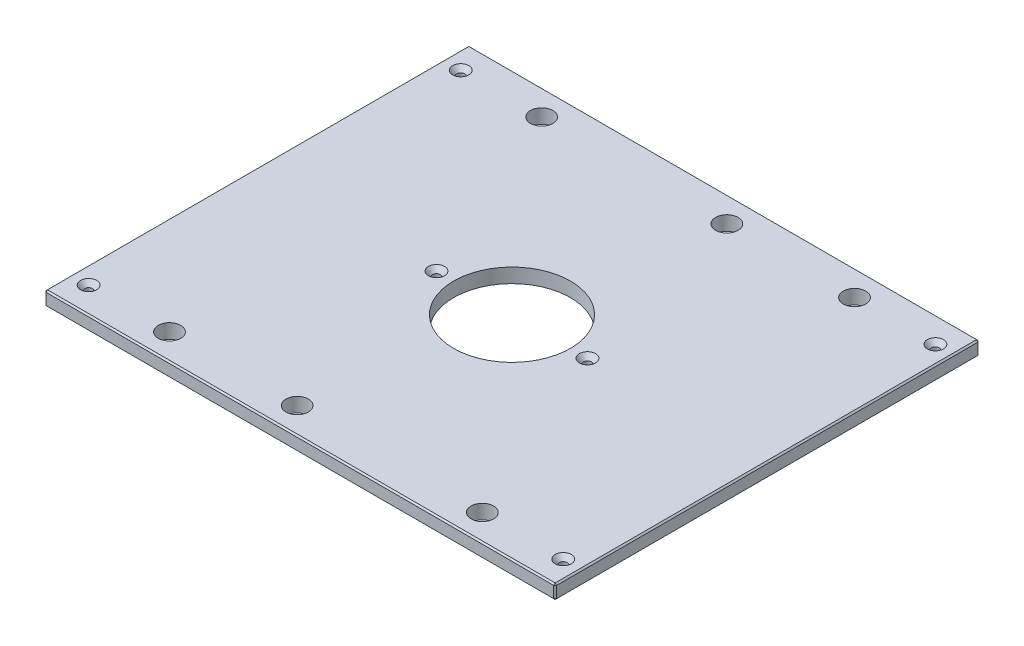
ISO-10303-21;
HEADER;
FILE_DESCRIPTION(('STEP AP214'),'2;1');
FILE_NAME('part.step','',(''),(''),'','','');
FILE_SCHEMA(('AUTOMOTIVE_DESIGN { 1 0 10303 214 1 1 1 1 }'));
ENDSEC;
DATA;
#1=APPLICATION_CONTEXT('core data for automotive mechanical design processes');
#2=APPLICATION_PROTOCOL_DEFINITION('international standard','automotive_design',2000,#1);
#3=PRODUCT_CONTEXT('',#1,'mechanical');
#4=PRODUCT('Part','Part','',(#3));
#5=PRODUCT_RELATED_PRODUCT_CATEGORY('part','',(#4));
#6=PRODUCT_DEFINITION_FORMATION('','',#4);
#7=PRODUCT_DEFINITION_CONTEXT('part definition',#1,'design');
#8=PRODUCT_DEFINITION('design','',#6,#7);
#9=PRODUCT_DEFINITION_SHAPE('','',#8);
#10=(LENGTH_UNIT() NAMED_UNIT(*) SI_UNIT(.MILLI.,.METRE.));
#11=(NAMED_UNIT(*) PLANE_ANGLE_UNIT() SI_UNIT($,.RADIAN.));
#12=(NAMED_UNIT(*) SI_UNIT($,.STERADIAN.) SOLID_ANGLE_UNIT());
#13=UNCERTAINTY_MEASURE_WITH_UNIT(LENGTH_MEASURE(1.E-05),#10,'distance_accuracy_value','');
#14=(GEOMETRIC_REPRESENTATION_CONTEXT(3) GLOBAL_UNCERTAINTY_ASSIGNED_CONTEXT((#13)) GLOBAL_UNIT_ASSIGNED_CONTEXT((#10,
#11,#12)) REPRESENTATION_CONTEXT('',''));
#15=CARTESIAN_POINT('',(0.,0.,0.));
#16=DIRECTION('',(0.,0.,1.));
#17=DIRECTION('',(1.,0.,0.));
#18=AXIS2_PLACEMENT_3D('',#15,#16,#17);
#19=CARTESIAN_POINT('',(-225.425,12.7,-187.325));
#20=DIRECTION('',(1.,0.,0.));
#21=DIRECTION('',(0.,0.,-1.));
#22=AXIS2_PLACEMENT_3D('',#19,#20,#21);
#23=PLANE('',#22);
#24=DIRECTION('',(0.,0.,-1.));
#25=VECTOR('',#24,1.);
#26=CARTESIAN_POINT('',(-225.425,11.4300000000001,-187.325));
#27=LINE('',#26,#25);
#28=CARTESIAN_POINT('',(-225.425,11.4300000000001,186.055));
#29=VERTEX_POINT('',#28);
#30=CARTESIAN_POINT('',(-225.425,11.4300000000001,-186.055));
#31=VERTEX_POINT('',#30);
#32=EDGE_CURVE('E140',#29,#31,#27,.T.);
#33=ORIENTED_EDGE('',*,*,#32,.T.);
#34=DIRECTION('',(0.,-1.,0.));
#35=VECTOR('',#34,1.);
#36=CARTESIAN_POINT('',(-225.425,12.7,-186.055));
#37=LINE('',#36,#35);
#38=CARTESIAN_POINT('',(-225.425,1.26999999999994,-186.055));
#39=VERTEX_POINT('',#38);
#40=EDGE_CURVE('E135',#31,#39,#37,.T.);
#41=ORIENTED_EDGE('',*,*,#40,.T.);
#42=DIRECTION('',(0.,0.,1.));
#43=VECTOR('',#42,1.);
#44=CARTESIAN_POINT('',(-225.425,1.26999999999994,-187.325));
#45=LINE('',#44,#43);
#46=CARTESIAN_POINT('',(-225.425,1.26999999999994,186.055));
#47=VERTEX_POINT('',#46);
#48=EDGE_CURVE('E130',#39,#47,#45,.T.);
#49=ORIENTED_EDGE('',*,*,#48,.T.);
#50=DIRECTION('',(0.,1.,0.));
#51=VECTOR('',#50,1.);
#52=CARTESIAN_POINT('',(-225.425,12.7,186.055));
#53=LINE('',#52,#51);
#54=EDGE_CURVE('E132',#47,#29,#53,.T.);
#55=ORIENTED_EDGE('',*,*,#54,.T.);
#56=EDGE_LOOP('',(#33,#41,#49,#55));
#57=FACE_BOUND('',#56,.T.);
#58=ADVANCED_FACE('F38',(#57),#23,.F.);
#59=CARTESIAN_POINT('',(-225.425,12.7,187.325));
#60=DIRECTION('',(0.,0.,-1.));
#61=DIRECTION('',(-1.,0.,0.));
#62=AXIS2_PLACEMENT_3D('',#59,#60,#61);
#63=PLANE('',#62);
#64=DIRECTION('',(1.,0.,0.));
#65=VECTOR('',#64,1.);
#66=CARTESIAN_POINT('',(-225.425,1.26999999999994,187.325));
#67=LINE('',#66,#65);
#68=CARTESIAN_POINT('',(-224.155,1.26999999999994,187.325));
#69=VERTEX_POINT('',#68);
#70=CARTESIAN_POINT('',(224.155,1.26999999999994,187.325));
#71=VERTEX_POINT('',#70);
#72=EDGE_CURVE('E62',#69,#71,#67,.T.);
#73=ORIENTED_EDGE('',*,*,#72,.T.);
#74=DIRECTION('',(0.,1.,0.));
#75=VECTOR('',#74,1.);
#76=CARTESIAN_POINT('',(224.155,12.7,187.325));
#77=LINE('',#76,#75);
#78=CARTESIAN_POINT('',(224.155,11.4300000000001,187.325));
#79=VERTEX_POINT('',#78);
#80=EDGE_CURVE('E11',#71,#79,#77,.T.);
#81=ORIENTED_EDGE('',*,*,#80,.T.);
#82=DIRECTION('',(-1.,0.,0.));
#83=VECTOR('',#82,1.);
#84=CARTESIAN_POINT('',(-225.425,11.4300000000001,187.325));
#85=LINE('',#84,#83);
#86=CARTESIAN_POINT('',(-224.155,11.4300000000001,187.325));
#87=VERTEX_POINT('',#86);
#88=EDGE_CURVE('E48',#79,#87,#85,.T.);
#89=ORIENTED_EDGE('',*,*,#88,.T.);
#90=DIRECTION('',(0.,-1.,0.));
#91=VECTOR('',#90,1.);
#92=CARTESIAN_POINT('',(-224.155,12.7,187.325));
#93=LINE('',#92,#91);
#94=EDGE_CURVE('E349',#87,#69,#93,.T.);
#95=ORIENTED_EDGE('',*,*,#94,.T.);
#96=EDGE_LOOP('',(#73,#81,#89,#95));
#97=FACE_BOUND('',#96,.T.);
#98=ADVANCED_FACE('F427',(#97),#63,.F.);
#99=CARTESIAN_POINT('',(225.425,12.7,-187.325));
#100=DIRECTION('',(-1.,0.,0.));
#101=DIRECTION('',(0.,0.,1.));
#102=AXIS2_PLACEMENT_3D('',#99,#100,#101);
#103=PLANE('',#102);
#104=DIRECTION('',(0.,0.,-1.));
#105=VECTOR('',#104,1.);
#106=CARTESIAN_POINT('',(225.425,1.26999999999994,-187.325));
#107=LINE('',#106,#105);
#108=CARTESIAN_POINT('',(225.425,1.26999999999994,186.055));
#109=VERTEX_POINT('',#108);
#110=CARTESIAN_POINT('',(225.425,1.26999999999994,-186.055));
#111=VERTEX_POINT('',#110);
#112=EDGE_CURVE('E342',#109,#111,#107,.T.);
#113=ORIENTED_EDGE('',*,*,#112,.T.);
#114=DIRECTION('',(0.,1.,0.));
#115=VECTOR('',#114,1.);
#116=CARTESIAN_POINT('',(225.425,12.7,-186.055));
#117=LINE('',#116,#115);
#118=CARTESIAN_POINT('',(225.425,11.4300000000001,-186.055));
#119=VERTEX_POINT('',#118);
#120=EDGE_CURVE('E345',#111,#119,#117,.T.);
#121=ORIENTED_EDGE('',*,*,#120,.T.);
#122=DIRECTION('',(0.,0.,1.));
#123=VECTOR('',#122,1.);
#124=CARTESIAN_POINT('',(225.425,11.4300000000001,187.325));
#125=LINE('',#124,#123);
#126=CARTESIAN_POINT('',(225.425,11.4300000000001,186.055));
#127=VERTEX_POINT('',#126);
#128=EDGE_CURVE('E339',#119,#127,#125,.T.);
#129=ORIENTED_EDGE('',*,*,#128,.T.);
#130=DIRECTION('',(0.,-1.,0.));
#131=VECTOR('',#130,1.);
#132=CARTESIAN_POINT('',(225.425,12.7,186.055));
#133=LINE('',#132,#131);
#134=EDGE_CURVE('E336',#127,#109,#133,.T.);
#135=ORIENTED_EDGE('',*,*,#134,.T.);
#136=EDGE_LOOP('',(#113,#121,#129,#135));
#137=FACE_BOUND('',#136,.T.);
#138=ADVANCED_FACE('F414',(#137),#103,.F.);
#139=CARTESIAN_POINT('',(-225.425,12.7,-187.325));
#140=DIRECTION('',(0.,0.,1.));
#141=DIRECTION('',(1.,0.,0.));
#142=AXIS2_PLACEMENT_3D('',#139,#140,#141);
#143=PLANE('',#142);
#144=DIRECTION('',(-1.,0.,0.));
#145=VECTOR('',#144,1.);
#146=CARTESIAN_POINT('',(-225.425,1.26999999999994,-187.325));
#147=LINE('',#146,#145);
#148=CARTESIAN_POINT('',(224.155,1.26999999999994,-187.325));
#149=VERTEX_POINT('',#148);
#150=CARTESIAN_POINT('',(-224.155,1.26999999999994,-187.325));
#151=VERTEX_POINT('',#150);
#152=EDGE_CURVE('E301',#149,#151,#147,.T.);
#153=ORIENTED_EDGE('',*,*,#152,.T.);
#154=DIRECTION('',(0.,1.,0.));
#155=VECTOR('',#154,1.);
#156=CARTESIAN_POINT('',(-224.155,12.7,-187.325));
#157=LINE('',#156,#155);
#158=CARTESIAN_POINT('',(-224.155,11.4300000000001,-187.325));
#159=VERTEX_POINT('',#158);
#160=EDGE_CURVE('E307',#151,#159,#157,.T.);
#161=ORIENTED_EDGE('',*,*,#160,.T.);
#162=DIRECTION('',(1.,0.,0.));
#163=VECTOR('',#162,1.);
#164=CARTESIAN_POINT('',(225.425,11.4300000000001,-187.325));
#165=LINE('',#164,#163);
#166=CARTESIAN_POINT('',(224.155,11.4300000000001,-187.325));
#167=VERTEX_POINT('',#166);
#168=EDGE_CURVE('E304',#159,#167,#165,.T.);
#169=ORIENTED_EDGE('',*,*,#168,.T.);
#170=DIRECTION('',(0.,-1.,0.));
#171=VECTOR('',#170,1.);
#172=CARTESIAN_POINT('',(224.155,12.7,-187.325));
#173=LINE('',#172,#171);
#174=EDGE_CURVE('E299',#167,#149,#173,.T.);
#175=ORIENTED_EDGE('',*,*,#174,.T.);
#176=EDGE_LOOP('',(#153,#161,#169,#175));
#177=FACE_BOUND('',#176,.T.);
#178=ADVANCED_FACE('F388',(#177),#143,.F.);
#179=CARTESIAN_POINT('',(0.,12.7,0.));
#180=DIRECTION('',(0.,1.,0.));
#181=DIRECTION('',(0.,0.,1.));
#182=AXIS2_PLACEMENT_3D('',#179,#180,#181);
#183=PLANE('',#182);
#184=CARTESIAN_POINT('',(209.55,12.7,-164.30498));
#185=DIRECTION('',(0.,1.,0.));
#186=DIRECTION('',(0.,0.,1.));
#187=AXIS2_PLACEMENT_3D('',#184,#185,#186);
#188=CIRCLE('',#187,7.13739999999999);
#189=CARTESIAN_POINT('',(209.55,12.7,-157.16758));
#190=VERTEX_POINT('',#189);
#191=EDGE_CURVE('E927',#190,#190,#188,.T.);
#192=ORIENTED_EDGE('',*,*,#191,.F.);
#193=EDGE_LOOP('',(#192));
#194=FACE_BOUND('',#193,.T.);
#195=CARTESIAN_POINT('',(209.55,12.7,164.30498));
#196=DIRECTION('',(0.,1.,0.));
#197=DIRECTION('',(0.,0.,1.));
#198=AXIS2_PLACEMENT_3D('',#195,#196,#197);
#199=CIRCLE('',#198,7.13739999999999);
#200=CARTESIAN_POINT('',(209.55,12.7,171.44238));
#201=VERTEX_POINT('',#200);
#202=EDGE_CURVE('E931',#201,#201,#199,.T.);
#203=ORIENTED_EDGE('',*,*,#202,.F.);
#204=EDGE_LOOP('',(#203));
#205=FACE_BOUND('',#204,.T.);
#206=CARTESIAN_POINT('',(-209.55,12.7,164.30498));
#207=DIRECTION('',(0.,1.,0.));
#208=DIRECTION('',(0.,0.,1.));
#209=AXIS2_PLACEMENT_3D('',#206,#207,#208);
#210=CIRCLE('',#209,7.13739999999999);
#211=CARTESIAN_POINT('',(-209.55,12.7,171.44238));
#212=VERTEX_POINT('',#211);
#213=EDGE_CURVE('E935',#212,#212,#210,.T.);
#214=ORIENTED_EDGE('',*,*,#213,.F.);
#215=EDGE_LOOP('',(#214));
#216=FACE_BOUND('',#215,.T.);
#217=CARTESIAN_POINT('',(-66.675,12.7,0.));
#218=DIRECTION('',(0.,1.,0.));
#219=DIRECTION('',(0.,0.,1.));
#220=AXIS2_PLACEMENT_3D('',#217,#218,#219);
#221=CIRCLE('',#220,7.1374);
#222=CARTESIAN_POINT('',(-66.675,12.7,7.1374));
#223=VERTEX_POINT('',#222);
#224=EDGE_CURVE('E939',#223,#223,#221,.T.);
#225=ORIENTED_EDGE('',*,*,#224,.F.);
#226=EDGE_LOOP('',(#225));
#227=FACE_BOUND('',#226,.T.);
#228=CARTESIAN_POINT('',(66.675,12.7,0.));
#229=DIRECTION('',(0.,1.,0.));
#230=DIRECTION('',(0.,0.,1.));
#231=AXIS2_PLACEMENT_3D('',#228,#229,#230);
#232=CIRCLE('',#231,7.1374);
#233=CARTESIAN_POINT('',(66.675,12.7,7.1374));
#234=VERTEX_POINT('',#233);
#235=EDGE_CURVE('E943',#234,#234,#232,.T.);
#236=ORIENTED_EDGE('',*,*,#235,.F.);
#237=EDGE_LOOP('',(#236));
#238=FACE_BOUND('',#237,.T.);
#239=CARTESIAN_POINT('',(-209.55,12.7,-164.30498));
#240=DIRECTION('',(0.,1.,0.));
#241=DIRECTION('',(0.,0.,1.));
#242=AXIS2_PLACEMENT_3D('',#239,#240,#241);
#243=CIRCLE('',#242,7.13739999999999);
#244=CARTESIAN_POINT('',(-209.55,12.7,-157.16758));
#245=VERTEX_POINT('',#244);
#246=EDGE_CURVE('E946',#245,#245,#243,.T.);
#247=ORIENTED_EDGE('',*,*,#246,.F.);
#248=EDGE_LOOP('',(#247));
#249=FACE_BOUND('',#248,.T.);
#250=DIRECTION('',(0.,0.,-1.));
#251=VECTOR('',#250,1.);
#252=CARTESIAN_POINT('',(224.155,12.7,-187.325));
#253=LINE('',#252,#251);
#254=CARTESIAN_POINT('',(224.155,12.7,186.055));
#255=VERTEX_POINT('',#254);
#256=CARTESIAN_POINT('',(224.155,12.7,-186.055));
#257=VERTEX_POINT('',#256);
#258=EDGE_CURVE('E317',#255,#257,#253,.T.);
#259=ORIENTED_EDGE('',*,*,#258,.T.);
#260=DIRECTION('',(-1.,0.,0.));
#261=VECTOR('',#260,1.);
#262=CARTESIAN_POINT('',(-225.425,12.7,-186.055));
#263=LINE('',#262,#261);
#264=CARTESIAN_POINT('',(-224.155,12.7,-186.055));
#265=VERTEX_POINT('',#264);
#266=EDGE_CURVE('E320',#257,#265,#263,.T.);
#267=ORIENTED_EDGE('',*,*,#266,.T.);
#268=DIRECTION('',(0.,0.,1.));
#269=VECTOR('',#268,1.);
#270=CARTESIAN_POINT('',(-224.155,12.7,187.325));
#271=LINE('',#270,#269);
#272=CARTESIAN_POINT('',(-224.155,12.7,186.055));
#273=VERTEX_POINT('',#272);
#274=EDGE_CURVE('E314',#265,#273,#271,.T.);
#275=ORIENTED_EDGE('',*,*,#274,.T.);
#276=DIRECTION('',(1.,0.,0.));
#277=VECTOR('',#276,1.);
#278=CARTESIAN_POINT('',(225.425,12.7,186.055));
#279=LINE('',#278,#277);
#280=EDGE_CURVE('E311',#273,#255,#279,.T.);
#281=ORIENTED_EDGE('',*,*,#280,.T.);
#282=EDGE_LOOP('',(#259,#267,#275,#281));
#283=FACE_BOUND('',#282,.T.);
#284=CARTESIAN_POINT('',(138.1125,12.7,-164.30498));
#285=DIRECTION('',(0.,1.,0.));
#286=DIRECTION('',(0.,0.,1.));
#287=AXIS2_PLACEMENT_3D('',#284,#285,#286);
#288=CIRCLE('',#287,9.921875);
#289=CARTESIAN_POINT('',(138.1125,12.7,-154.383105));
#290=VERTEX_POINT('',#289);
#291=EDGE_CURVE('E230',#290,#290,#288,.T.);
#292=ORIENTED_EDGE('',*,*,#291,.F.);
#293=EDGE_LOOP('',(#292));
#294=FACE_BOUND('',#293,.T.);
#295=CARTESIAN_POINT('',(-138.1125,12.7,-164.30498));
#296=DIRECTION('',(0.,1.,0.));
#297=DIRECTION('',(0.,0.,1.));
#298=AXIS2_PLACEMENT_3D('',#295,#296,#297);
#299=CIRCLE('',#298,9.921875);
#300=CARTESIAN_POINT('',(-138.1125,12.7,-154.383105));
#301=VERTEX_POINT('',#300);
#302=EDGE_CURVE('E244',#301,#301,#299,.T.);
#303=ORIENTED_EDGE('',*,*,#302,.F.);
#304=EDGE_LOOP('',(#303));
#305=FACE_BOUND('',#304,.T.);
#306=CARTESIAN_POINT('',(138.1125,12.7,164.30498));
#307=DIRECTION('',(0.,1.,0.));
#308=DIRECTION('',(0.,0.,1.));
#309=AXIS2_PLACEMENT_3D('',#306,#307,#308);
#310=CIRCLE('',#309,9.921875);
#311=CARTESIAN_POINT('',(138.1125,12.7,174.226855));
#312=VERTEX_POINT('',#311);
#313=EDGE_CURVE('E257',#312,#312,#310,.T.);
#314=ORIENTED_EDGE('',*,*,#313,.F.);
#315=EDGE_LOOP('',(#314));
#316=FACE_BOUND('',#315,.T.);
#317=CARTESIAN_POINT('',(-138.1125,12.7,164.30498));
#318=DIRECTION('',(0.,1.,0.));
#319=DIRECTION('',(0.,0.,1.));
#320=AXIS2_PLACEMENT_3D('',#317,#318,#319);
#321=CIRCLE('',#320,9.921875);
#322=CARTESIAN_POINT('',(-138.1125,12.7,174.226855));
#323=VERTEX_POINT('',#322);
#324=EDGE_CURVE('E265',#323,#323,#321,.T.);
#325=ORIENTED_EDGE('',*,*,#324,.F.);
#326=EDGE_LOOP('',(#325));
#327=FACE_BOUND('',#326,.T.);
#328=CARTESIAN_POINT('',(25.4,12.7,-164.30498));
#329=DIRECTION('',(0.,1.,0.));
#330=DIRECTION('',(0.,0.,1.));
#331=AXIS2_PLACEMENT_3D('',#328,#329,#330);
#332=CIRCLE('',#331,9.921875);
#333=CARTESIAN_POINT('',(25.4,12.7,-154.383105));
#334=VERTEX_POINT('',#333);
#335=EDGE_CURVE('E273',#334,#334,#332,.T.);
#336=ORIENTED_EDGE('',*,*,#335,.F.);
#337=EDGE_LOOP('',(#336));
#338=FACE_BOUND('',#337,.T.);
#339=CARTESIAN_POINT('',(-25.4,12.7,164.30498));
#340=DIRECTION('',(0.,1.,0.));
#341=DIRECTION('',(0.,0.,1.));
#342=AXIS2_PLACEMENT_3D('',#339,#340,#341);
#343=CIRCLE('',#342,9.921875);
#344=CARTESIAN_POINT('',(-25.4,12.7,174.226855));
#345=VERTEX_POINT('',#344);
#346=EDGE_CURVE('E281',#345,#345,#343,.T.);
#347=ORIENTED_EDGE('',*,*,#346,.F.);
#348=EDGE_LOOP('',(#347));
#349=FACE_BOUND('',#348,.T.);
#350=CARTESIAN_POINT('',(0.,12.7,0.));
#351=DIRECTION('',(0.,1.,0.));
#352=DIRECTION('',(0.,0.,1.));
#353=AXIS2_PLACEMENT_3D('',#350,#351,#352);
#354=CIRCLE('',#353,51.562);
#355=CARTESIAN_POINT('',(0.,12.7,51.562));
#356=VERTEX_POINT('',#355);
#357=EDGE_CURVE('E288',#356,#356,#354,.T.);
#358=ORIENTED_EDGE('',*,*,#357,.F.);
#359=EDGE_LOOP('',(#358));
#360=FACE_BOUND('',#359,.T.);
#361=ADVANCED_FACE('F436',(#194,#205,#216,#227,#238,#249,#283,#294,#305,#316,#327,#338,#349,
#360),#183,.T.);
#362=CARTESIAN_POINT('',(0.,0.,0.));
#363=DIRECTION('',(0.,1.,0.));
#364=DIRECTION('',(0.,0.,1.));
#365=AXIS2_PLACEMENT_3D('',#362,#363,#364);
#366=PLANE('',#365);
#367=CARTESIAN_POINT('',(209.55,0.,-164.30498));
#368=DIRECTION('',(0.,1.,0.));
#369=DIRECTION('',(0.,0.,1.));
#370=AXIS2_PLACEMENT_3D('',#367,#368,#369);
#371=CIRCLE('',#370,3.3782);
#372=CARTESIAN_POINT('',(209.55,0.,-160.92678));
#373=VERTEX_POINT('',#372);
#374=EDGE_CURVE('E993',#373,#373,#371,.T.);
#375=ORIENTED_EDGE('',*,*,#374,.T.);
#376=EDGE_LOOP('',(#375));
#377=FACE_BOUND('',#376,.T.);
#378=CARTESIAN_POINT('',(209.55,0.,164.30498));
#379=DIRECTION('',(0.,1.,0.));
#380=DIRECTION('',(0.,0.,1.));
#381=AXIS2_PLACEMENT_3D('',#378,#379,#380);
#382=CIRCLE('',#381,3.3782);
#383=CARTESIAN_POINT('',(209.55,0.,167.68318));
#384=VERTEX_POINT('',#383);
#385=EDGE_CURVE('E984',#384,#384,#382,.T.);
#386=ORIENTED_EDGE('',*,*,#385,.T.);
#387=EDGE_LOOP('',(#386));
#388=FACE_BOUND('',#387,.T.);
#389=CARTESIAN_POINT('',(-209.55,0.,164.30498));
#390=DIRECTION('',(0.,1.,0.));
#391=DIRECTION('',(0.,0.,1.));
#392=AXIS2_PLACEMENT_3D('',#389,#390,#391);
#393=CIRCLE('',#392,3.3782);
#394=CARTESIAN_POINT('',(-209.55,0.,167.68318));
#395=VERTEX_POINT('',#394);
#396=EDGE_CURVE('E974',#395,#395,#393,.T.);
#397=ORIENTED_EDGE('',*,*,#396,.T.);
#398=EDGE_LOOP('',(#397));
#399=FACE_BOUND('',#398,.T.);
#400=CARTESIAN_POINT('',(-66.675,0.,0.));
#401=DIRECTION('',(0.,1.,0.));
#402=DIRECTION('',(0.,0.,1.));
#403=AXIS2_PLACEMENT_3D('',#400,#401,#402);
#404=CIRCLE('',#403,3.3782);
#405=CARTESIAN_POINT('',(-66.675,0.,3.3782));
#406=VERTEX_POINT('',#405);
#407=EDGE_CURVE('E964',#406,#406,#404,.T.);
#408=ORIENTED_EDGE('',*,*,#407,.T.);
#409=EDGE_LOOP('',(#408));
#410=FACE_BOUND('',#409,.T.);
#411=CARTESIAN_POINT('',(66.675,0.,0.));
#412=DIRECTION('',(0.,1.,0.));
#413=DIRECTION('',(0.,0.,1.));
#414=AXIS2_PLACEMENT_3D('',#411,#412,#413);
#415=CIRCLE('',#414,3.3782);
#416=CARTESIAN_POINT('',(66.675,0.,3.3782));
#417=VERTEX_POINT('',#416);
#418=EDGE_CURVE('E950',#417,#417,#415,.T.);
#419=ORIENTED_EDGE('',*,*,#418,.T.);
#420=EDGE_LOOP('',(#419));
#421=FACE_BOUND('',#420,.T.);
#422=CARTESIAN_POINT('',(-209.55,0.,-164.30498));
#423=DIRECTION('',(0.,1.,0.));
#424=DIRECTION('',(0.,0.,1.));
#425=AXIS2_PLACEMENT_3D('',#422,#423,#424);
#426=CIRCLE('',#425,3.3782);
#427=CARTESIAN_POINT('',(-209.55,0.,-160.92678));
#428=VERTEX_POINT('',#427);
#429=EDGE_CURVE('E247',#428,#428,#426,.T.);
#430=ORIENTED_EDGE('',*,*,#429,.T.);
#431=EDGE_LOOP('',(#430));
#432=FACE_BOUND('',#431,.T.);
#433=DIRECTION('',(0.,0.,-1.));
#434=VECTOR('',#433,1.);
#435=CARTESIAN_POINT('',(-224.155,0.,0.));
#436=LINE('',#435,#434);
#437=CARTESIAN_POINT('',(-224.155,0.,186.055));
#438=VERTEX_POINT('',#437);
#439=CARTESIAN_POINT('',(-224.155,0.,-186.055));
#440=VERTEX_POINT('',#439);
#441=EDGE_CURVE('E165',#438,#440,#436,.T.);
#442=ORIENTED_EDGE('',*,*,#441,.T.);
#443=DIRECTION('',(1.,0.,0.));
#444=VECTOR('',#443,1.);
#445=CARTESIAN_POINT('',(0.,0.,-186.055));
#446=LINE('',#445,#444);
#447=CARTESIAN_POINT('',(224.155,0.,-186.055));
#448=VERTEX_POINT('',#447);
#449=EDGE_CURVE('E332',#440,#448,#446,.T.);
#450=ORIENTED_EDGE('',*,*,#449,.T.);
#451=DIRECTION('',(0.,0.,1.));
#452=VECTOR('',#451,1.);
#453=CARTESIAN_POINT('',(224.155,0.,0.));
#454=LINE('',#453,#452);
#455=CARTESIAN_POINT('',(224.155,0.,186.055));
#456=VERTEX_POINT('',#455);
#457=EDGE_CURVE('E329',#448,#456,#454,.T.);
#458=ORIENTED_EDGE('',*,*,#457,.T.);
#459=DIRECTION('',(-1.,0.,0.));
#460=VECTOR('',#459,1.);
#461=CARTESIAN_POINT('',(0.,0.,186.055));
#462=LINE('',#461,#460);
#463=EDGE_CURVE('E324',#456,#438,#462,.T.);
#464=ORIENTED_EDGE('',*,*,#463,.T.);
#465=EDGE_LOOP('',(#442,#450,#458,#464));
#466=FACE_BOUND('',#465,.T.);
#467=CARTESIAN_POINT('',(138.1125,0.,-164.30498));
#468=DIRECTION('',(0.,1.,0.));
#469=DIRECTION('',(0.,0.,1.));
#470=AXIS2_PLACEMENT_3D('',#467,#468,#469);
#471=CIRCLE('',#470,9.921875);
#472=CARTESIAN_POINT('',(138.1125,0.,-154.383105));
#473=VERTEX_POINT('',#472);
#474=EDGE_CURVE('E237',#473,#473,#471,.T.);
#475=ORIENTED_EDGE('',*,*,#474,.T.);
#476=EDGE_LOOP('',(#475));
#477=FACE_BOUND('',#476,.T.);
#478=CARTESIAN_POINT('',(-138.1125,0.,-164.30498));
#479=DIRECTION('',(0.,1.,0.));
#480=DIRECTION('',(0.,0.,1.));
#481=AXIS2_PLACEMENT_3D('',#478,#479,#480);
#482=CIRCLE('',#481,9.921875);
#483=CARTESIAN_POINT('',(-138.1125,0.,-154.383105));
#484=VERTEX_POINT('',#483);
#485=EDGE_CURVE('E253',#484,#484,#482,.T.);
#486=ORIENTED_EDGE('',*,*,#485,.T.);
#487=EDGE_LOOP('',(#486));
#488=FACE_BOUND('',#487,.T.);
#489=CARTESIAN_POINT('',(138.1125,0.,164.30498));
#490=DIRECTION('',(0.,1.,0.));
#491=DIRECTION('',(0.,0.,1.));
#492=AXIS2_PLACEMENT_3D('',#489,#490,#491);
#493=CIRCLE('',#492,9.921875);
#494=CARTESIAN_POINT('',(138.1125,0.,174.226855));
#495=VERTEX_POINT('',#494);
#496=EDGE_CURVE('E261',#495,#495,#493,.T.);
#497=ORIENTED_EDGE('',*,*,#496,.T.);
#498=EDGE_LOOP('',(#497));
#499=FACE_BOUND('',#498,.T.);
#500=CARTESIAN_POINT('',(-138.1125,0.,164.30498));
#501=DIRECTION('',(0.,1.,0.));
#502=DIRECTION('',(0.,0.,1.));
#503=AXIS2_PLACEMENT_3D('',#500,#501,#502);
#504=CIRCLE('',#503,9.921875);
#505=CARTESIAN_POINT('',(-138.1125,0.,174.226855));
#506=VERTEX_POINT('',#505);
#507=EDGE_CURVE('E269',#506,#506,#504,.T.);
#508=ORIENTED_EDGE('',*,*,#507,.T.);
#509=EDGE_LOOP('',(#508));
#510=FACE_BOUND('',#509,.T.);
#511=CARTESIAN_POINT('',(25.4,0.,-164.30498));
#512=DIRECTION('',(0.,1.,0.));
#513=DIRECTION('',(0.,0.,1.));
#514=AXIS2_PLACEMENT_3D('',#511,#512,#513);
#515=CIRCLE('',#514,9.921875);
#516=CARTESIAN_POINT('',(25.4,0.,-154.383105));
#517=VERTEX_POINT('',#516);
#518=EDGE_CURVE('E277',#517,#517,#515,.T.);
#519=ORIENTED_EDGE('',*,*,#518,.T.);
#520=EDGE_LOOP('',(#519));
#521=FACE_BOUND('',#520,.T.);
#522=CARTESIAN_POINT('',(-25.4,0.,164.30498));
#523=DIRECTION('',(0.,1.,0.));
#524=DIRECTION('',(0.,0.,1.));
#525=AXIS2_PLACEMENT_3D('',#522,#523,#524);
#526=CIRCLE('',#525,9.921875);
#527=CARTESIAN_POINT('',(-25.4,0.,174.226855));
#528=VERTEX_POINT('',#527);
#529=EDGE_CURVE('E284',#528,#528,#526,.T.);
#530=ORIENTED_EDGE('',*,*,#529,.T.);
#531=EDGE_LOOP('',(#530));
#532=FACE_BOUND('',#531,.T.);
#533=CARTESIAN_POINT('',(0.,0.,0.));
#534=DIRECTION('',(0.,1.,0.));
#535=DIRECTION('',(0.,0.,1.));
#536=AXIS2_PLACEMENT_3D('',#533,#534,#535);
#537=CIRCLE('',#536,51.562);
#538=CARTESIAN_POINT('',(0.,0.,51.562));
#539=VERTEX_POINT('',#538);
#540=EDGE_CURVE('E153',#539,#539,#537,.T.);
#541=ORIENTED_EDGE('',*,*,#540,.T.);
#542=EDGE_LOOP('',(#541));
#543=FACE_BOUND('',#542,.T.);
#544=ADVANCED_FACE('F401',(#377,#388,#399,#410,#421,#432,#466,#477,#488,#499,#510,#521,#532,
#543),#366,.F.);
#545=CARTESIAN_POINT('',(0.,0.,0.));
#546=DIRECTION('',(0.,1.,0.));
#547=DIRECTION('',(0.,0.,1.));
#548=AXIS2_PLACEMENT_3D('',#545,#546,#547);
#549=CYLINDRICAL_SURFACE('',#548,51.562);
#550=ORIENTED_EDGE('',*,*,#540,.F.);
#551=EDGE_LOOP('',(#550));
#552=FACE_BOUND('',#551,.T.);
#553=ORIENTED_EDGE('',*,*,#357,.T.);
#554=EDGE_LOOP('',(#553));
#555=FACE_BOUND('',#554,.T.);
#556=ADVANCED_FACE('F682',(#552,#555),#549,.F.);
#557=CARTESIAN_POINT('',(-25.4,12.7,164.30498));
#558=DIRECTION('',(0.,1.,0.));
#559=DIRECTION('',(0.,0.,1.));
#560=AXIS2_PLACEMENT_3D('',#557,#558,#559);
#561=CYLINDRICAL_SURFACE('',#560,9.921875);
#562=ORIENTED_EDGE('',*,*,#529,.F.);
#563=EDGE_LOOP('',(#562));
#564=FACE_BOUND('',#563,.T.);
#565=ORIENTED_EDGE('',*,*,#346,.T.);
#566=EDGE_LOOP('',(#565));
#567=FACE_BOUND('',#566,.T.);
#568=ADVANCED_FACE('F856',(#564,#567),#561,.F.);
#569=CARTESIAN_POINT('',(25.4,12.7,-164.30498));
#570=DIRECTION('',(0.,1.,0.));
#571=DIRECTION('',(0.,0.,1.));
#572=AXIS2_PLACEMENT_3D('',#569,#570,#571);
#573=CYLINDRICAL_SURFACE('',#572,9.921875);
#574=ORIENTED_EDGE('',*,*,#518,.F.);
#575=EDGE_LOOP('',(#574));
#576=FACE_BOUND('',#575,.T.);
#577=ORIENTED_EDGE('',*,*,#335,.T.);
#578=EDGE_LOOP('',(#577));
#579=FACE_BOUND('',#578,.T.);
#580=ADVANCED_FACE('F846',(#576,#579),#573,.F.);
#581=CARTESIAN_POINT('',(-138.1125,12.7,164.30498));
#582=DIRECTION('',(0.,1.,0.));
#583=DIRECTION('',(0.,0.,1.));
#584=AXIS2_PLACEMENT_3D('',#581,#582,#583);
#585=CYLINDRICAL_SURFACE('',#584,9.921875);
#586=ORIENTED_EDGE('',*,*,#507,.F.);
#587=EDGE_LOOP('',(#586));
#588=FACE_BOUND('',#587,.T.);
#589=ORIENTED_EDGE('',*,*,#324,.T.);
#590=EDGE_LOOP('',(#589));
#591=FACE_BOUND('',#590,.T.);
#592=ADVANCED_FACE('F836',(#588,#591),#585,.F.);
#593=CARTESIAN_POINT('',(138.1125,12.7,164.30498));
#594=DIRECTION('',(0.,1.,0.));
#595=DIRECTION('',(0.,0.,1.));
#596=AXIS2_PLACEMENT_3D('',#593,#594,#595);
#597=CYLINDRICAL_SURFACE('',#596,9.921875);
#598=ORIENTED_EDGE('',*,*,#496,.F.);
#599=EDGE_LOOP('',(#598));
#600=FACE_BOUND('',#599,.T.);
#601=ORIENTED_EDGE('',*,*,#313,.T.);
#602=EDGE_LOOP('',(#601));
#603=FACE_BOUND('',#602,.T.);
#604=ADVANCED_FACE('F826',(#600,#603),#597,.F.);
#605=CARTESIAN_POINT('',(-138.1125,12.7,-164.30498));
#606=DIRECTION('',(0.,1.,0.));
#607=DIRECTION('',(0.,0.,1.));
#608=AXIS2_PLACEMENT_3D('',#605,#606,#607);
#609=CYLINDRICAL_SURFACE('',#608,9.921875);
#610=ORIENTED_EDGE('',*,*,#485,.F.);
#611=EDGE_LOOP('',(#610));
#612=FACE_BOUND('',#611,.T.);
#613=ORIENTED_EDGE('',*,*,#302,.T.);
#614=EDGE_LOOP('',(#613));
#615=FACE_BOUND('',#614,.T.);
#616=ADVANCED_FACE('F816',(#612,#615),#609,.F.);
#617=CARTESIAN_POINT('',(138.1125,12.7,-164.30498));
#618=DIRECTION('',(0.,1.,0.));
#619=DIRECTION('',(0.,0.,1.));
#620=AXIS2_PLACEMENT_3D('',#617,#618,#619);
#621=CYLINDRICAL_SURFACE('',#620,9.921875);
#622=ORIENTED_EDGE('',*,*,#474,.F.);
#623=EDGE_LOOP('',(#622));
#624=FACE_BOUND('',#623,.T.);
#625=ORIENTED_EDGE('',*,*,#291,.T.);
#626=EDGE_LOOP('',(#625));
#627=FACE_BOUND('',#626,.T.);
#628=ADVANCED_FACE('F445',(#624,#627),#621,.F.);
#629=CARTESIAN_POINT('',(225.425,12.7,186.055));
#630=DIRECTION('',(-0.707106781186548,0.,-0.707106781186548));
#631=DIRECTION('',(0.,-1.,0.));
#632=AXIS2_PLACEMENT_3D('',#629,#630,#631);
#633=PLANE('',#632);
#634=DIRECTION('',(-0.707106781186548,0.,0.707106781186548));
#635=VECTOR('',#634,1.);
#636=CARTESIAN_POINT('',(225.425,11.4300000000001,186.055));
#637=LINE('',#636,#635);
#638=EDGE_CURVE('E42',#79,#127,#637,.F.);
#639=ORIENTED_EDGE('',*,*,#638,.F.);
#640=ORIENTED_EDGE('',*,*,#80,.F.);
#641=DIRECTION('',(0.707106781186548,0.,-0.707106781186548));
#642=VECTOR('',#641,1.);
#643=CARTESIAN_POINT('',(224.79,1.26999999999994,186.69));
#644=LINE('',#643,#642);
#645=EDGE_CURVE('E220',#109,#71,#644,.F.);
#646=ORIENTED_EDGE('',*,*,#645,.F.);
#647=ORIENTED_EDGE('',*,*,#134,.F.);
#648=EDGE_LOOP('',(#639,#640,#646,#647));
#649=FACE_BOUND('',#648,.T.);
#650=ADVANCED_FACE('F40',(#649),#633,.F.);
#651=CARTESIAN_POINT('',(225.425,11.4300000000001,186.055));
#652=DIRECTION('',(0.577350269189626,0.577350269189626,0.577350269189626));
#653=DIRECTION('',(0.707106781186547,0.,-0.707106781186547));
#654=AXIS2_PLACEMENT_3D('',#651,#652,#653);
#655=PLANE('',#654);
#656=DIRECTION('',(0.,-0.707106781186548,0.707106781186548));
#657=VECTOR('',#656,1.);
#658=CARTESIAN_POINT('',(224.155,12.065,186.69));
#659=LINE('',#658,#657);
#660=EDGE_CURVE('E214',#79,#255,#659,.F.);
#661=ORIENTED_EDGE('',*,*,#660,.F.);
#662=ORIENTED_EDGE('',*,*,#638,.T.);
#663=DIRECTION('',(-0.707106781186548,0.707106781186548,0.));
#664=VECTOR('',#663,1.);
#665=CARTESIAN_POINT('',(225.425,11.4300000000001,186.055));
#666=LINE('',#665,#664);
#667=EDGE_CURVE('E217',#255,#127,#666,.F.);
#668=ORIENTED_EDGE('',*,*,#667,.F.);
#669=EDGE_LOOP('',(#661,#662,#668));
#670=FACE_BOUND('',#669,.T.);
#671=ADVANCED_FACE('F438',(#670),#655,.T.);
#672=CARTESIAN_POINT('',(224.155,0.,186.055));
#673=DIRECTION('',(0.577350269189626,-0.577350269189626,0.577350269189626));
#674=DIRECTION('',(0.707106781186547,0.,-0.707106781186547));
#675=AXIS2_PLACEMENT_3D('',#672,#673,#674);
#676=PLANE('',#675);
#677=DIRECTION('',(-0.707106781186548,-0.707106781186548,0.));
#678=VECTOR('',#677,1.);
#679=CARTESIAN_POINT('',(224.155,0.,186.055));
#680=LINE('',#679,#678);
#681=EDGE_CURVE('E206',#109,#456,#680,.T.);
#682=ORIENTED_EDGE('',*,*,#681,.F.);
#683=ORIENTED_EDGE('',*,*,#645,.T.);
#684=DIRECTION('',(0.,0.707106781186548,0.707106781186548));
#685=VECTOR('',#684,1.);
#686=CARTESIAN_POINT('',(224.155,0.,186.055));
#687=LINE('',#686,#685);
#688=EDGE_CURVE('E210',#456,#71,#687,.T.);
#689=ORIENTED_EDGE('',*,*,#688,.F.);
#690=EDGE_LOOP('',(#682,#683,#689));
#691=FACE_BOUND('',#690,.T.);
#692=ADVANCED_FACE('F407',(#691),#676,.T.);
#693=CARTESIAN_POINT('',(224.155,12.7,0.));
#694=DIRECTION('',(0.707106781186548,0.707106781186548,0.));
#695=DIRECTION('',(0.,0.,1.));
#696=AXIS2_PLACEMENT_3D('',#693,#694,#695);
#697=PLANE('',#696);
#698=ORIENTED_EDGE('',*,*,#667,.T.);
#699=ORIENTED_EDGE('',*,*,#128,.F.);
#700=DIRECTION('',(0.707106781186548,-0.707106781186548,0.));
#701=VECTOR('',#700,1.);
#702=CARTESIAN_POINT('',(224.79,12.065,-186.055));
#703=LINE('',#702,#701);
#704=EDGE_CURVE('E200',#257,#119,#703,.T.);
#705=ORIENTED_EDGE('',*,*,#704,.F.);
#706=ORIENTED_EDGE('',*,*,#258,.F.);
#707=EDGE_LOOP('',(#698,#699,#705,#706));
#708=FACE_BOUND('',#707,.T.);
#709=ADVANCED_FACE('F424',(#708),#697,.T.);
#710=CARTESIAN_POINT('',(0.,12.7,186.055));
#711=DIRECTION('',(0.,0.707106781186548,0.707106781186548));
#712=DIRECTION('',(-1.,0.,0.));
#713=AXIS2_PLACEMENT_3D('',#710,#711,#712);
#714=PLANE('',#713);
#715=ORIENTED_EDGE('',*,*,#660,.T.);
#716=ORIENTED_EDGE('',*,*,#280,.F.);
#717=DIRECTION('',(0.,0.707106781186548,-0.707106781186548));
#718=VECTOR('',#717,1.);
#719=CARTESIAN_POINT('',(-224.155,12.7,186.055));
#720=LINE('',#719,#718);
#721=EDGE_CURVE('E196',#87,#273,#720,.T.);
#722=ORIENTED_EDGE('',*,*,#721,.F.);
#723=ORIENTED_EDGE('',*,*,#88,.F.);
#724=EDGE_LOOP('',(#715,#716,#722,#723));
#725=FACE_BOUND('',#724,.T.);
#726=ADVANCED_FACE('F429',(#725),#714,.T.);
#727=CARTESIAN_POINT('',(-224.155,12.7,187.325));
#728=DIRECTION('',(0.707106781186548,0.,-0.707106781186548));
#729=DIRECTION('',(0.,-1.,0.));
#730=AXIS2_PLACEMENT_3D('',#727,#728,#729);
#731=PLANE('',#730);
#732=DIRECTION('',(0.707106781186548,0.,0.707106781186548));
#733=VECTOR('',#732,1.);
#734=CARTESIAN_POINT('',(-225.425,1.26999999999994,186.055));
#735=LINE('',#734,#733);
#736=EDGE_CURVE('E147',#69,#47,#735,.F.);
#737=ORIENTED_EDGE('',*,*,#736,.F.);
#738=ORIENTED_EDGE('',*,*,#94,.F.);
#739=DIRECTION('',(-0.707106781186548,0.,-0.707106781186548));
#740=VECTOR('',#739,1.);
#741=CARTESIAN_POINT('',(-224.79,11.4300000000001,186.69));
#742=LINE('',#741,#740);
#743=EDGE_CURVE('E150',#29,#87,#742,.F.);
#744=ORIENTED_EDGE('',*,*,#743,.F.);
#745=ORIENTED_EDGE('',*,*,#54,.F.);
#746=EDGE_LOOP('',(#737,#738,#744,#745));
#747=FACE_BOUND('',#746,.T.);
#748=ADVANCED_FACE('F145',(#747),#731,.F.);
#749=CARTESIAN_POINT('',(-225.425,1.26999999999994,187.325));
#750=DIRECTION('',(0.,0.707106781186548,-0.707106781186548));
#751=DIRECTION('',(1.,0.,0.));
#752=AXIS2_PLACEMENT_3D('',#749,#750,#751);
#753=PLANE('',#752);
#754=ORIENTED_EDGE('',*,*,#688,.T.);
#755=ORIENTED_EDGE('',*,*,#72,.F.);
#756=DIRECTION('',(0.,-0.707106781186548,-0.707106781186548));
#757=VECTOR('',#756,1.);
#758=CARTESIAN_POINT('',(-224.155,0.634999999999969,186.69));
#759=LINE('',#758,#757);
#760=EDGE_CURVE('E161',#438,#69,#759,.F.);
#761=ORIENTED_EDGE('',*,*,#760,.F.);
#762=ORIENTED_EDGE('',*,*,#463,.F.);
#763=EDGE_LOOP('',(#754,#755,#761,#762));
#764=FACE_BOUND('',#763,.T.);
#765=ADVANCED_FACE('F406',(#764),#753,.F.);
#766=CARTESIAN_POINT('',(225.425,1.26999999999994,-187.325));
#767=DIRECTION('',(-0.707106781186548,0.707106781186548,0.));
#768=DIRECTION('',(0.,0.,-1.));
#769=AXIS2_PLACEMENT_3D('',#766,#767,#768);
#770=PLANE('',#769);
#771=ORIENTED_EDGE('',*,*,#681,.T.);
#772=ORIENTED_EDGE('',*,*,#457,.F.);
#773=DIRECTION('',(0.707106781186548,0.707106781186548,0.));
#774=VECTOR('',#773,1.);
#775=CARTESIAN_POINT('',(224.155,0.,-186.055));
#776=LINE('',#775,#774);
#777=EDGE_CURVE('E188',#111,#448,#776,.F.);
#778=ORIENTED_EDGE('',*,*,#777,.F.);
#779=ORIENTED_EDGE('',*,*,#112,.F.);
#780=EDGE_LOOP('',(#771,#772,#778,#779));
#781=FACE_BOUND('',#780,.T.);
#782=ADVANCED_FACE('F411',(#781),#770,.F.);
#783=CARTESIAN_POINT('',(224.155,12.7,-187.325));
#784=DIRECTION('',(-0.707106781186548,0.,0.707106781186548));
#785=DIRECTION('',(0.,-1.,0.));
#786=AXIS2_PLACEMENT_3D('',#783,#784,#785);
#787=PLANE('',#786);
#788=DIRECTION('',(0.707106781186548,0.,0.707106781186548));
#789=VECTOR('',#788,1.);
#790=CARTESIAN_POINT('',(224.155,11.4300000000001,-187.325));
#791=LINE('',#790,#789);
#792=EDGE_CURVE('E203',#119,#167,#791,.F.);
#793=ORIENTED_EDGE('',*,*,#792,.F.);
#794=ORIENTED_EDGE('',*,*,#120,.F.);
#795=DIRECTION('',(-0.707106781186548,0.,-0.707106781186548));
#796=VECTOR('',#795,1.);
#797=CARTESIAN_POINT('',(224.79,1.26999999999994,-186.69));
#798=LINE('',#797,#796);
#799=EDGE_CURVE('E184',#149,#111,#798,.F.);
#800=ORIENTED_EDGE('',*,*,#799,.F.);
#801=ORIENTED_EDGE('',*,*,#174,.F.);
#802=EDGE_LOOP('',(#793,#794,#800,#801));
#803=FACE_BOUND('',#802,.T.);
#804=ADVANCED_FACE('F419',(#803),#787,.F.);
#805=CARTESIAN_POINT('',(224.155,11.4300000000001,-187.325));
#806=DIRECTION('',(0.577350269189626,0.577350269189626,-0.577350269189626));
#807=DIRECTION('',(-0.707106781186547,0.,-0.707106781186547));
#808=AXIS2_PLACEMENT_3D('',#805,#806,#807);
#809=PLANE('',#808);
#810=ORIENTED_EDGE('',*,*,#704,.T.);
#811=ORIENTED_EDGE('',*,*,#792,.T.);
#812=DIRECTION('',(0.,0.707106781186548,0.707106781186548));
#813=VECTOR('',#812,1.);
#814=CARTESIAN_POINT('',(224.155,11.4300000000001,-187.325));
#815=LINE('',#814,#813);
#816=EDGE_CURVE('E174',#257,#167,#815,.F.);
#817=ORIENTED_EDGE('',*,*,#816,.F.);
#818=EDGE_LOOP('',(#810,#811,#817));
#819=FACE_BOUND('',#818,.T.);
#820=ADVANCED_FACE('F477',(#819),#809,.T.);
#821=CARTESIAN_POINT('',(-224.155,12.7,186.055));
#822=DIRECTION('',(-0.577350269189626,0.577350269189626,0.577350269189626));
#823=DIRECTION('',(0.707106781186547,0.,0.707106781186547));
#824=AXIS2_PLACEMENT_3D('',#821,#822,#823);
#825=PLANE('',#824);
#826=ORIENTED_EDGE('',*,*,#743,.T.);
#827=ORIENTED_EDGE('',*,*,#721,.T.);
#828=DIRECTION('',(-0.707106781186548,-0.707106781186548,0.));
#829=VECTOR('',#828,1.);
#830=CARTESIAN_POINT('',(-224.155,12.7,186.055));
#831=LINE('',#830,#829);
#832=EDGE_CURVE('E167',#29,#273,#831,.F.);
#833=ORIENTED_EDGE('',*,*,#832,.F.);
#834=EDGE_LOOP('',(#826,#827,#833));
#835=FACE_BOUND('',#834,.T.);
#836=ADVANCED_FACE('F431',(#835),#825,.T.);
#837=CARTESIAN_POINT('',(-225.425,1.26999999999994,186.055));
#838=DIRECTION('',(-0.577350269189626,-0.577350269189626,0.577350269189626));
#839=DIRECTION('',(0.707106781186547,0.,0.707106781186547));
#840=AXIS2_PLACEMENT_3D('',#837,#838,#839);
#841=PLANE('',#840);
#842=ORIENTED_EDGE('',*,*,#760,.T.);
#843=ORIENTED_EDGE('',*,*,#736,.T.);
#844=DIRECTION('',(-0.707106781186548,0.707106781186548,0.));
#845=VECTOR('',#844,1.);
#846=CARTESIAN_POINT('',(-225.425,1.26999999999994,186.055));
#847=LINE('',#846,#845);
#848=EDGE_CURVE('E158',#438,#47,#847,.T.);
#849=ORIENTED_EDGE('',*,*,#848,.F.);
#850=EDGE_LOOP('',(#842,#843,#849));
#851=FACE_BOUND('',#850,.T.);
#852=ADVANCED_FACE('F157',(#851),#841,.T.);
#853=CARTESIAN_POINT('',(224.155,0.,-186.055));
#854=DIRECTION('',(0.577350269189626,-0.577350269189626,-0.577350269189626));
#855=DIRECTION('',(-0.707106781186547,0.,-0.707106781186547));
#856=AXIS2_PLACEMENT_3D('',#853,#854,#855);
#857=PLANE('',#856);
#858=ORIENTED_EDGE('',*,*,#799,.T.);
#859=ORIENTED_EDGE('',*,*,#777,.T.);
#860=DIRECTION('',(0.,-0.707106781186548,0.707106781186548));
#861=VECTOR('',#860,1.);
#862=CARTESIAN_POINT('',(224.155,0.,-186.055));
#863=LINE('',#862,#861);
#864=EDGE_CURVE('E168',#149,#448,#863,.T.);
#865=ORIENTED_EDGE('',*,*,#864,.F.);
#866=EDGE_LOOP('',(#858,#859,#865));
#867=FACE_BOUND('',#866,.T.);
#868=ADVANCED_FACE('F469',(#867),#857,.T.);
#869=CARTESIAN_POINT('',(0.,12.7,-186.055));
#870=DIRECTION('',(0.,0.707106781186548,-0.707106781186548));
#871=DIRECTION('',(1.,0.,0.));
#872=AXIS2_PLACEMENT_3D('',#869,#870,#871);
#873=PLANE('',#872);
#874=ORIENTED_EDGE('',*,*,#816,.T.);
#875=ORIENTED_EDGE('',*,*,#168,.F.);
#876=DIRECTION('',(0.,-0.707106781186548,-0.707106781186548));
#877=VECTOR('',#876,1.);
#878=CARTESIAN_POINT('',(-224.155,11.4300000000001,-187.325));
#879=LINE('',#878,#877);
#880=EDGE_CURVE('E177',#265,#159,#879,.T.);
#881=ORIENTED_EDGE('',*,*,#880,.F.);
#882=ORIENTED_EDGE('',*,*,#266,.F.);
#883=EDGE_LOOP('',(#874,#875,#881,#882));
#884=FACE_BOUND('',#883,.T.);
#885=ADVANCED_FACE('F383',(#884),#873,.T.);
#886=CARTESIAN_POINT('',(-224.155,12.7,0.));
#887=DIRECTION('',(-0.707106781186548,0.707106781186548,0.));
#888=DIRECTION('',(0.,0.,-1.));
#889=AXIS2_PLACEMENT_3D('',#886,#887,#888);
#890=PLANE('',#889);
#891=ORIENTED_EDGE('',*,*,#832,.T.);
#892=ORIENTED_EDGE('',*,*,#274,.F.);
#893=DIRECTION('',(0.707106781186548,0.707106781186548,0.));
#894=VECTOR('',#893,1.);
#895=CARTESIAN_POINT('',(-224.79,12.065,-186.055));
#896=LINE('',#895,#894);
#897=EDGE_CURVE('E370',#31,#265,#896,.T.);
#898=ORIENTED_EDGE('',*,*,#897,.F.);
#899=ORIENTED_EDGE('',*,*,#32,.F.);
#900=EDGE_LOOP('',(#891,#892,#898,#899));
#901=FACE_BOUND('',#900,.T.);
#902=ADVANCED_FACE('F434',(#901),#890,.T.);
#903=CARTESIAN_POINT('',(-225.425,1.26999999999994,-187.325));
#904=DIRECTION('',(0.707106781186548,0.707106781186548,0.));
#905=DIRECTION('',(0.,0.,1.));
#906=AXIS2_PLACEMENT_3D('',#903,#904,#905);
#907=PLANE('',#906);
#908=ORIENTED_EDGE('',*,*,#848,.T.);
#909=ORIENTED_EDGE('',*,*,#48,.F.);
#910=DIRECTION('',(0.707106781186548,-0.707106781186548,0.));
#911=VECTOR('',#910,1.);
#912=CARTESIAN_POINT('',(-225.425,1.26999999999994,-186.055));
#913=LINE('',#912,#911);
#914=EDGE_CURVE('E366',#440,#39,#913,.F.);
#915=ORIENTED_EDGE('',*,*,#914,.F.);
#916=ORIENTED_EDGE('',*,*,#441,.F.);
#917=EDGE_LOOP('',(#908,#909,#915,#916));
#918=FACE_BOUND('',#917,.T.);
#919=ADVANCED_FACE('F164',(#918),#907,.F.);
#920=CARTESIAN_POINT('',(-225.425,1.26999999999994,-187.325));
#921=DIRECTION('',(0.,0.707106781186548,0.707106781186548));
#922=DIRECTION('',(-1.,0.,0.));
#923=AXIS2_PLACEMENT_3D('',#920,#921,#922);
#924=PLANE('',#923);
#925=ORIENTED_EDGE('',*,*,#864,.T.);
#926=ORIENTED_EDGE('',*,*,#449,.F.);
#927=DIRECTION('',(0.,0.707106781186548,-0.707106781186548));
#928=VECTOR('',#927,1.);
#929=CARTESIAN_POINT('',(-224.155,0.634999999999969,-186.69));
#930=LINE('',#929,#928);
#931=EDGE_CURVE('E362',#151,#440,#930,.F.);
#932=ORIENTED_EDGE('',*,*,#931,.F.);
#933=ORIENTED_EDGE('',*,*,#152,.F.);
#934=EDGE_LOOP('',(#925,#926,#932,#933));
#935=FACE_BOUND('',#934,.T.);
#936=ADVANCED_FACE('F398',(#935),#924,.F.);
#937=CARTESIAN_POINT('',(-224.155,11.4300000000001,-187.325));
#938=DIRECTION('',(-0.577350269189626,0.577350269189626,-0.577350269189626));
#939=DIRECTION('',(-0.707106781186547,0.,0.707106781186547));
#940=AXIS2_PLACEMENT_3D('',#937,#938,#939);
#941=PLANE('',#940);
#942=ORIENTED_EDGE('',*,*,#897,.T.);
#943=ORIENTED_EDGE('',*,*,#880,.T.);
#944=DIRECTION('',(0.707106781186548,0.,-0.707106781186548));
#945=VECTOR('',#944,1.);
#946=CARTESIAN_POINT('',(-224.155,11.4300000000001,-187.325));
#947=LINE('',#946,#945);
#948=EDGE_CURVE('E359',#31,#159,#947,.T.);
#949=ORIENTED_EDGE('',*,*,#948,.F.);
#950=EDGE_LOOP('',(#942,#943,#949));
#951=FACE_BOUND('',#950,.T.);
#952=ADVANCED_FACE('F378',(#951),#941,.T.);
#953=CARTESIAN_POINT('',(-225.425,1.26999999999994,-186.055));
#954=DIRECTION('',(-0.577350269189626,-0.577350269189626,-0.577350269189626));
#955=DIRECTION('',(-0.707106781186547,0.,0.707106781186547));
#956=AXIS2_PLACEMENT_3D('',#953,#954,#955);
#957=PLANE('',#956);
#958=ORIENTED_EDGE('',*,*,#931,.T.);
#959=ORIENTED_EDGE('',*,*,#914,.T.);
#960=DIRECTION('',(-0.707106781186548,0.,0.707106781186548));
#961=VECTOR('',#960,1.);
#962=CARTESIAN_POINT('',(-225.425,1.26999999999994,-186.055));
#963=LINE('',#962,#961);
#964=EDGE_CURVE('E356',#151,#39,#963,.T.);
#965=ORIENTED_EDGE('',*,*,#964,.F.);
#966=EDGE_LOOP('',(#958,#959,#965));
#967=FACE_BOUND('',#966,.T.);
#968=ADVANCED_FACE('F395',(#967),#957,.T.);
#969=CARTESIAN_POINT('',(-225.425,12.7,-186.055));
#970=DIRECTION('',(0.707106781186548,0.,0.707106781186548));
#971=DIRECTION('',(0.,-1.,0.));
#972=AXIS2_PLACEMENT_3D('',#969,#970,#971);
#973=PLANE('',#972);
#974=ORIENTED_EDGE('',*,*,#948,.T.);
#975=ORIENTED_EDGE('',*,*,#160,.F.);
#976=ORIENTED_EDGE('',*,*,#964,.T.);
#977=ORIENTED_EDGE('',*,*,#40,.F.);
#978=EDGE_LOOP('',(#974,#975,#976,#977));
#979=FACE_BOUND('',#978,.T.);
#980=ADVANCED_FACE('F393',(#979),#973,.F.);
#981=CARTESIAN_POINT('',(-209.55,12.7,-164.30498));
#982=DIRECTION('',(0.,1.,0.));
#983=DIRECTION('',(0.,0.,1.));
#984=AXIS2_PLACEMENT_3D('',#981,#982,#983);
#985=CYLINDRICAL_SURFACE('',#984,3.3782);
#986=ORIENTED_EDGE('',*,*,#429,.F.);
#987=EDGE_LOOP('',(#986));
#988=FACE_BOUND('',#987,.T.);
#989=CARTESIAN_POINT('',(-209.55,8.37553508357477,-164.30498));
#990=DIRECTION('',(0.,1.,0.));
#991=DIRECTION('',(0.,0.,1.));
#992=AXIS2_PLACEMENT_3D('',#989,#990,#991);
#993=CIRCLE('',#992,3.3782);
#994=CARTESIAN_POINT('',(-209.55,8.37553508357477,-160.92678));
#995=VERTEX_POINT('',#994);
#996=EDGE_CURVE('E949',#995,#995,#993,.T.);
#997=ORIENTED_EDGE('',*,*,#996,.T.);
#998=EDGE_LOOP('',(#997));
#999=FACE_BOUND('',#998,.T.);
#1000=ADVANCED_FACE('F456',(#988,#999),#985,.F.);
#1001=CARTESIAN_POINT('',(-209.55,12.7,-164.30498));
#1002=DIRECTION('',(0.,1.,0.));
#1003=DIRECTION('',(0.,0.,1.));
#1004=AXIS2_PLACEMENT_3D('',#1001,#1002,#1003);
#1005=CONICAL_SURFACE('',#1004,7.13739999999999,0.715584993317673);
#1006=ORIENTED_EDGE('',*,*,#996,.F.);
#1007=EDGE_LOOP('',(#1006));
#1008=FACE_BOUND('',#1007,.T.);
#1009=ORIENTED_EDGE('',*,*,#246,.T.);
#1010=EDGE_LOOP('',(#1009));
#1011=FACE_BOUND('',#1010,.T.);
#1012=ADVANCED_FACE('F548',(#1008,#1011),#1005,.F.);
#1013=CARTESIAN_POINT('',(66.675,12.7,0.));
#1014=DIRECTION('',(0.,1.,0.));
#1015=DIRECTION('',(0.,0.,1.));
#1016=AXIS2_PLACEMENT_3D('',#1013,#1014,#1015);
#1017=CYLINDRICAL_SURFACE('',#1016,3.3782);
#1018=ORIENTED_EDGE('',*,*,#418,.F.);
#1019=EDGE_LOOP('',(#1018));
#1020=FACE_BOUND('',#1019,.T.);
#1021=CARTESIAN_POINT('',(66.675,8.37553508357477,0.));
#1022=DIRECTION('',(0.,1.,0.));
#1023=DIRECTION('',(0.,0.,1.));
#1024=AXIS2_PLACEMENT_3D('',#1021,#1022,#1023);
#1025=CIRCLE('',#1024,3.3782);
#1026=CARTESIAN_POINT('',(66.675,8.37553508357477,3.3782));
#1027=VERTEX_POINT('',#1026);
#1028=EDGE_CURVE('E956',#1027,#1027,#1025,.T.);
#1029=ORIENTED_EDGE('',*,*,#1028,.T.);
#1030=EDGE_LOOP('',(#1029));
#1031=FACE_BOUND('',#1030,.T.);
#1032=ADVANCED_FACE('F555',(#1020,#1031),#1017,.F.);
#1033=CARTESIAN_POINT('',(66.675,12.7,0.));
#1034=DIRECTION('',(0.,1.,0.));
#1035=DIRECTION('',(0.,0.,1.));
#1036=AXIS2_PLACEMENT_3D('',#1033,#1034,#1035);
#1037=CONICAL_SURFACE('',#1036,7.1374,0.715584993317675);
#1038=ORIENTED_EDGE('',*,*,#1028,.F.);
#1039=EDGE_LOOP('',(#1038));
#1040=FACE_BOUND('',#1039,.T.);
#1041=ORIENTED_EDGE('',*,*,#235,.T.);
#1042=EDGE_LOOP('',(#1041));
#1043=FACE_BOUND('',#1042,.T.);
#1044=ADVANCED_FACE('F562',(#1040,#1043),#1037,.F.);
#1045=CARTESIAN_POINT('',(-66.675,12.7,0.));
#1046=DIRECTION('',(0.,1.,0.));
#1047=DIRECTION('',(0.,0.,1.));
#1048=AXIS2_PLACEMENT_3D('',#1045,#1046,#1047);
#1049=CYLINDRICAL_SURFACE('',#1048,3.3782);
#1050=ORIENTED_EDGE('',*,*,#407,.F.);
#1051=EDGE_LOOP('',(#1050));
#1052=FACE_BOUND('',#1051,.T.);
#1053=CARTESIAN_POINT('',(-66.675,8.37553508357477,0.));
#1054=DIRECTION('',(0.,1.,0.));
#1055=DIRECTION('',(0.,0.,1.));
#1056=AXIS2_PLACEMENT_3D('',#1053,#1054,#1055);
#1057=CIRCLE('',#1056,3.3782);
#1058=CARTESIAN_POINT('',(-66.675,8.37553508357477,3.3782));
#1059=VERTEX_POINT('',#1058);
#1060=EDGE_CURVE('E968',#1059,#1059,#1057,.T.);
#1061=ORIENTED_EDGE('',*,*,#1060,.T.);
#1062=EDGE_LOOP('',(#1061));
#1063=FACE_BOUND('',#1062,.T.);
#1064=ADVANCED_FACE('F569',(#1052,#1063),#1049,.F.);
#1065=CARTESIAN_POINT('',(-66.675,12.7,0.));
#1066=DIRECTION('',(0.,1.,0.));
#1067=DIRECTION('',(0.,0.,1.));
#1068=AXIS2_PLACEMENT_3D('',#1065,#1066,#1067);
#1069=CONICAL_SURFACE('',#1068,7.1374,0.715584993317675);
#1070=ORIENTED_EDGE('',*,*,#1060,.F.);
#1071=EDGE_LOOP('',(#1070));
#1072=FACE_BOUND('',#1071,.T.);
#1073=ORIENTED_EDGE('',*,*,#224,.T.);
#1074=EDGE_LOOP('',(#1073));
#1075=FACE_BOUND('',#1074,.T.);
#1076=ADVANCED_FACE('F576',(#1072,#1075),#1069,.F.);
#1077=CARTESIAN_POINT('',(-209.55,12.7,164.30498));
#1078=DIRECTION('',(0.,1.,0.));
#1079=DIRECTION('',(0.,0.,1.));
#1080=AXIS2_PLACEMENT_3D('',#1077,#1078,#1079);
#1081=CYLINDRICAL_SURFACE('',#1080,3.3782);
#1082=ORIENTED_EDGE('',*,*,#396,.F.);
#1083=EDGE_LOOP('',(#1082));
#1084=FACE_BOUND('',#1083,.T.);
#1085=CARTESIAN_POINT('',(-209.55,8.37553508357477,164.30498));
#1086=DIRECTION('',(0.,1.,0.));
#1087=DIRECTION('',(0.,0.,1.));
#1088=AXIS2_PLACEMENT_3D('',#1085,#1086,#1087);
#1089=CIRCLE('',#1088,3.3782);
#1090=CARTESIAN_POINT('',(-209.55,8.37553508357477,167.68318));
#1091=VERTEX_POINT('',#1090);
#1092=EDGE_CURVE('E978',#1091,#1091,#1089,.T.);
#1093=ORIENTED_EDGE('',*,*,#1092,.T.);
#1094=EDGE_LOOP('',(#1093));
#1095=FACE_BOUND('',#1094,.T.);
#1096=ADVANCED_FACE('F583',(#1084,#1095),#1081,.F.);
#1097=CARTESIAN_POINT('',(-209.55,12.7,164.30498));
#1098=DIRECTION('',(0.,1.,0.));
#1099=DIRECTION('',(0.,0.,1.));
#1100=AXIS2_PLACEMENT_3D('',#1097,#1098,#1099);
#1101=CONICAL_SURFACE('',#1100,7.13739999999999,0.715584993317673);
#1102=ORIENTED_EDGE('',*,*,#1092,.F.);
#1103=EDGE_LOOP('',(#1102));
#1104=FACE_BOUND('',#1103,.T.);
#1105=ORIENTED_EDGE('',*,*,#213,.T.);
#1106=EDGE_LOOP('',(#1105));
#1107=FACE_BOUND('',#1106,.T.);
#1108=ADVANCED_FACE('F590',(#1104,#1107),#1101,.F.);
#1109=CARTESIAN_POINT('',(209.55,12.7,164.30498));
#1110=DIRECTION('',(0.,1.,0.));
#1111=DIRECTION('',(0.,0.,1.));
#1112=AXIS2_PLACEMENT_3D('',#1109,#1110,#1111);
#1113=CYLINDRICAL_SURFACE('',#1112,3.3782);
#1114=ORIENTED_EDGE('',*,*,#385,.F.);
#1115=EDGE_LOOP('',(#1114));
#1116=FACE_BOUND('',#1115,.T.);
#1117=CARTESIAN_POINT('',(209.55,8.37553508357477,164.30498));
#1118=DIRECTION('',(0.,1.,0.));
#1119=DIRECTION('',(0.,0.,1.));
#1120=AXIS2_PLACEMENT_3D('',#1117,#1118,#1119);
#1121=CIRCLE('',#1120,3.3782);
#1122=CARTESIAN_POINT('',(209.55,8.37553508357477,167.68318));
#1123=VERTEX_POINT('',#1122);
#1124=EDGE_CURVE('E987',#1123,#1123,#1121,.T.);
#1125=ORIENTED_EDGE('',*,*,#1124,.T.);
#1126=EDGE_LOOP('',(#1125));
#1127=FACE_BOUND('',#1126,.T.);
#1128=ADVANCED_FACE('F597',(#1116,#1127),#1113,.F.);
#1129=CARTESIAN_POINT('',(209.55,12.7,164.30498));
#1130=DIRECTION('',(0.,1.,0.));
#1131=DIRECTION('',(0.,0.,1.));
#1132=AXIS2_PLACEMENT_3D('',#1129,#1130,#1131);
#1133=CONICAL_SURFACE('',#1132,7.13739999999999,0.715584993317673);
#1134=ORIENTED_EDGE('',*,*,#1124,.F.);
#1135=EDGE_LOOP('',(#1134));
#1136=FACE_BOUND('',#1135,.T.);
#1137=ORIENTED_EDGE('',*,*,#202,.T.);
#1138=EDGE_LOOP('',(#1137));
#1139=FACE_BOUND('',#1138,.T.);
#1140=ADVANCED_FACE('F604',(#1136,#1139),#1133,.F.);
#1141=CARTESIAN_POINT('',(209.55,12.7,-164.30498));
#1142=DIRECTION('',(0.,1.,0.));
#1143=DIRECTION('',(0.,0.,1.));
#1144=AXIS2_PLACEMENT_3D('',#1141,#1142,#1143);
#1145=CYLINDRICAL_SURFACE('',#1144,3.3782);
#1146=ORIENTED_EDGE('',*,*,#374,.F.);
#1147=EDGE_LOOP('',(#1146));
#1148=FACE_BOUND('',#1147,.T.);
#1149=CARTESIAN_POINT('',(209.55,8.37553508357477,-164.30498));
#1150=DIRECTION('',(0.,1.,0.));
#1151=DIRECTION('',(0.,0.,1.));
#1152=AXIS2_PLACEMENT_3D('',#1149,#1150,#1151);
#1153=CIRCLE('',#1152,3.3782);
#1154=CARTESIAN_POINT('',(209.55,8.37553508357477,-160.92678));
#1155=VERTEX_POINT('',#1154);
#1156=EDGE_CURVE('E997',#1155,#1155,#1153,.T.);
#1157=ORIENTED_EDGE('',*,*,#1156,.T.);
#1158=EDGE_LOOP('',(#1157));
#1159=FACE_BOUND('',#1158,.T.);
#1160=ADVANCED_FACE('F611',(#1148,#1159),#1145,.F.);
#1161=CARTESIAN_POINT('',(209.55,12.7,-164.30498));
#1162=DIRECTION('',(0.,1.,0.));
#1163=DIRECTION('',(0.,0.,1.));
#1164=AXIS2_PLACEMENT_3D('',#1161,#1162,#1163);
#1165=CONICAL_SURFACE('',#1164,7.13739999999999,0.715584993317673);
#1166=ORIENTED_EDGE('',*,*,#1156,.F.);
#1167=EDGE_LOOP('',(#1166));
#1168=FACE_BOUND('',#1167,.T.);
#1169=ORIENTED_EDGE('',*,*,#191,.T.);
#1170=EDGE_LOOP('',(#1169));
#1171=FACE_BOUND('',#1170,.T.);
#1172=ADVANCED_FACE('F618',(#1168,#1171),#1165,.F.);
#1173=CLOSED_SHELL('',(#58,#98,#138,#178,#361,#544,#556,#568,#580,#592,#604,#616,#628,#650,#671,
#692,#709,#726,#748,#765,#782,#804,#820,#836,#852,#868,#885,#902,#919,#936,#952,#968,#980,#1000,
#1012,#1032,#1044,#1064,#1076,#1096,#1108,#1128,#1140,#1160,#1172));
#1174=MANIFOLD_SOLID_BREP('B2',#1173);
#1175=ADVANCED_BREP_SHAPE_REPRESENTATION('',(#18,#1174),#14);
#1176=SHAPE_DEFINITION_REPRESENTATION(#9,#1175);
ENDSEC;
END-ISO-10303-21;
